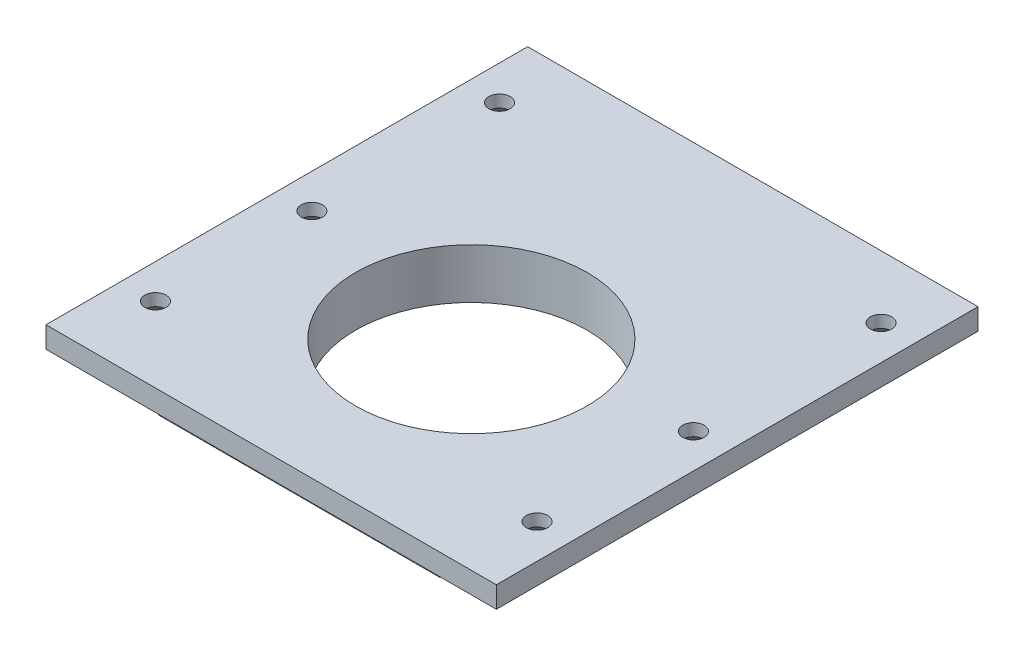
ISO-10303-21;
HEADER;
FILE_DESCRIPTION(('STEP AP214'),'2;1');
FILE_NAME('part.step','',(''),(''),'','','');
FILE_SCHEMA(('AUTOMOTIVE_DESIGN { 1 0 10303 214 1 1 1 1 }'));
ENDSEC;
DATA;
#1=APPLICATION_CONTEXT('core data for automotive mechanical design processes');
#2=APPLICATION_PROTOCOL_DEFINITION('international standard','automotive_design',2000,#1);
#3=PRODUCT_CONTEXT('',#1,'mechanical');
#4=PRODUCT('Part','Part','',(#3));
#5=PRODUCT_RELATED_PRODUCT_CATEGORY('part','',(#4));
#6=PRODUCT_DEFINITION_FORMATION('','',#4);
#7=PRODUCT_DEFINITION_CONTEXT('part definition',#1,'design');
#8=PRODUCT_DEFINITION('design','',#6,#7);
#9=PRODUCT_DEFINITION_SHAPE('','',#8);
#10=(LENGTH_UNIT() NAMED_UNIT(*) SI_UNIT(.MILLI.,.METRE.));
#11=(NAMED_UNIT(*) PLANE_ANGLE_UNIT() SI_UNIT($,.RADIAN.));
#12=(NAMED_UNIT(*) SI_UNIT($,.STERADIAN.) SOLID_ANGLE_UNIT());
#13=UNCERTAINTY_MEASURE_WITH_UNIT(LENGTH_MEASURE(1.E-05),#10,'distance_accuracy_value','');
#14=(GEOMETRIC_REPRESENTATION_CONTEXT(3) GLOBAL_UNCERTAINTY_ASSIGNED_CONTEXT((#13)) GLOBAL_UNIT_ASSIGNED_CONTEXT((#10,
#11,#12)) REPRESENTATION_CONTEXT('',''));
#15=CARTESIAN_POINT('',(0.,0.,0.));
#16=DIRECTION('',(0.,0.,1.));
#17=DIRECTION('',(1.,0.,0.));
#18=AXIS2_PLACEMENT_3D('',#15,#16,#17);
#19=CARTESIAN_POINT('',(36.,-4.,-45.));
#20=DIRECTION('',(0.,0.,1.));
#21=DIRECTION('',(1.,0.,0.));
#22=AXIS2_PLACEMENT_3D('',#19,#20,#21);
#23=PLANE('',#22);
#24=DIRECTION('',(0.,1.,0.));
#25=VECTOR('',#24,1.);
#26=CARTESIAN_POINT('',(36.,-4.,-45.));
#27=LINE('',#26,#25);
#28=CARTESIAN_POINT('',(36.,0.6,-45.));
#29=VERTEX_POINT('',#28);
#30=CARTESIAN_POINT('',(36.,4.,-45.));
#31=VERTEX_POINT('',#30);
#32=EDGE_CURVE('E247',#29,#31,#27,.T.);
#33=ORIENTED_EDGE('',*,*,#32,.F.);
#34=DIRECTION('',(1.,0.,0.));
#35=VECTOR('',#34,1.);
#36=CARTESIAN_POINT('',(-26.,0.599999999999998,-45.));
#37=LINE('',#36,#35);
#38=CARTESIAN_POINT('',(-36.,0.6,-45.));
#39=VERTEX_POINT('',#38);
#40=EDGE_CURVE('E234',#39,#29,#37,.T.);
#41=ORIENTED_EDGE('',*,*,#40,.F.);
#42=DIRECTION('',(0.,1.,0.));
#43=VECTOR('',#42,1.);
#44=CARTESIAN_POINT('',(-36.,-4.,-45.));
#45=LINE('',#44,#43);
#46=CARTESIAN_POINT('',(-36.,4.,-45.));
#47=VERTEX_POINT('',#46);
#48=EDGE_CURVE('E244',#39,#47,#45,.T.);
#49=ORIENTED_EDGE('',*,*,#48,.T.);
#50=DIRECTION('',(-1.,0.,0.));
#51=VECTOR('',#50,1.);
#52=CARTESIAN_POINT('',(36.,4.,-45.));
#53=LINE('',#52,#51);
#54=EDGE_CURVE('E263',#31,#47,#53,.T.);
#55=ORIENTED_EDGE('',*,*,#54,.F.);
#56=EDGE_LOOP('',(#33,#41,#49,#55));
#57=FACE_BOUND('',#56,.T.);
#58=ADVANCED_FACE('F34',(#57),#23,.F.);
#59=CARTESIAN_POINT('',(36.,-4.,32.));
#60=DIRECTION('',(0.,0.,-1.));
#61=DIRECTION('',(-1.,0.,0.));
#62=AXIS2_PLACEMENT_3D('',#59,#60,#61);
#63=PLANE('',#62);
#64=DIRECTION('',(-1.,0.,0.));
#65=VECTOR('',#64,1.);
#66=CARTESIAN_POINT('',(-26.,0.599999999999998,32.));
#67=LINE('',#66,#65);
#68=CARTESIAN_POINT('',(36.,0.6,32.));
#69=VERTEX_POINT('',#68);
#70=CARTESIAN_POINT('',(-36.,0.6,32.));
#71=VERTEX_POINT('',#70);
#72=EDGE_CURVE('E230',#69,#71,#67,.T.);
#73=ORIENTED_EDGE('',*,*,#72,.F.);
#74=DIRECTION('',(0.,-1.,0.));
#75=VECTOR('',#74,1.);
#76=CARTESIAN_POINT('',(36.,-4.,32.));
#77=LINE('',#76,#75);
#78=CARTESIAN_POINT('',(36.,4.,32.));
#79=VERTEX_POINT('',#78);
#80=EDGE_CURVE('E252',#79,#69,#77,.T.);
#81=ORIENTED_EDGE('',*,*,#80,.F.);
#82=DIRECTION('',(-1.,0.,0.));
#83=VECTOR('',#82,1.);
#84=CARTESIAN_POINT('',(36.,4.,32.));
#85=LINE('',#84,#83);
#86=CARTESIAN_POINT('',(-36.,4.,32.));
#87=VERTEX_POINT('',#86);
#88=EDGE_CURVE('E255',#79,#87,#85,.T.);
#89=ORIENTED_EDGE('',*,*,#88,.T.);
#90=DIRECTION('',(0.,-1.,0.));
#91=VECTOR('',#90,1.);
#92=CARTESIAN_POINT('',(-36.,-4.,32.));
#93=LINE('',#92,#91);
#94=EDGE_CURVE('E250',#87,#71,#93,.T.);
#95=ORIENTED_EDGE('',*,*,#94,.T.);
#96=EDGE_LOOP('',(#73,#81,#89,#95));
#97=FACE_BOUND('',#96,.T.);
#98=ADVANCED_FACE('F392',(#97),#63,.F.);
#99=CARTESIAN_POINT('',(36.,0.,0.));
#100=DIRECTION('',(-1.,0.,0.));
#101=DIRECTION('',(0.,0.,1.));
#102=AXIS2_PLACEMENT_3D('',#99,#100,#101);
#103=PLANE('',#102);
#104=DIRECTION('',(0.,0.,-1.));
#105=VECTOR('',#104,1.);
#106=CARTESIAN_POINT('',(36.,0.6,-45.));
#107=LINE('',#106,#105);
#108=EDGE_CURVE('E220',#69,#29,#107,.T.);
#109=ORIENTED_EDGE('',*,*,#108,.T.);
#110=ORIENTED_EDGE('',*,*,#32,.T.);
#111=DIRECTION('',(0.,0.,1.));
#112=VECTOR('',#111,1.);
#113=CARTESIAN_POINT('',(36.,4.,32.));
#114=LINE('',#113,#112);
#115=EDGE_CURVE('E249',#31,#79,#114,.T.);
#116=ORIENTED_EDGE('',*,*,#115,.T.);
#117=ORIENTED_EDGE('',*,*,#80,.T.);
#118=EDGE_LOOP('',(#109,#110,#116,#117));
#119=FACE_BOUND('',#118,.T.);
#120=ADVANCED_FACE('F401',(#119),#103,.F.);
#121=CARTESIAN_POINT('',(36.,0.5,32.));
#122=DIRECTION('',(0.,-1.,0.));
#123=DIRECTION('',(1.,0.,0.));
#124=AXIS2_PLACEMENT_3D('',#121,#122,#123);
#125=PLANE('',#124);
#126=DIRECTION('',(0.,0.,-1.));
#127=VECTOR('',#126,1.);
#128=CARTESIAN_POINT('',(20.4019237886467,0.499999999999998,32.));
#129=LINE('',#128,#127);
#130=CARTESIAN_POINT('',(20.4019237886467,0.499999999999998,27.5));
#131=VERTEX_POINT('',#130);
#132=CARTESIAN_POINT('',(20.4019237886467,0.499999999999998,-27.5));
#133=VERTEX_POINT('',#132);
#134=EDGE_CURVE('E223',#131,#133,#129,.T.);
#135=ORIENTED_EDGE('',*,*,#134,.T.);
#136=DIRECTION('',(-1.,0.,0.));
#137=VECTOR('',#136,1.);
#138=CARTESIAN_POINT('',(36.,0.5,-27.5));
#139=LINE('',#138,#137);
#140=CARTESIAN_POINT('',(26.,0.5,-27.5));
#141=VERTEX_POINT('',#140);
#142=EDGE_CURVE('E188',#141,#133,#139,.T.);
#143=ORIENTED_EDGE('',*,*,#142,.F.);
#144=DIRECTION('',(0.,0.,1.));
#145=VECTOR('',#144,1.);
#146=CARTESIAN_POINT('',(26.,0.499999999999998,-45.));
#147=LINE('',#146,#145);
#148=CARTESIAN_POINT('',(26.,0.5,27.5));
#149=VERTEX_POINT('',#148);
#150=EDGE_CURVE('E217',#141,#149,#147,.T.);
#151=ORIENTED_EDGE('',*,*,#150,.T.);
#152=DIRECTION('',(1.,0.,0.));
#153=VECTOR('',#152,1.);
#154=CARTESIAN_POINT('',(36.,0.5,27.5));
#155=LINE('',#154,#153);
#156=EDGE_CURVE('E209',#131,#149,#155,.T.);
#157=ORIENTED_EDGE('',*,*,#156,.F.);
#158=EDGE_LOOP('',(#135,#143,#151,#157));
#159=FACE_BOUND('',#158,.T.);
#160=ADVANCED_FACE('F367',(#159),#125,.T.);
#161=CARTESIAN_POINT('',(36.,-4.,32.));
#162=DIRECTION('',(0.,1.,0.));
#163=DIRECTION('',(0.,0.,1.));
#164=AXIS2_PLACEMENT_3D('',#161,#162,#163);
#165=PLANE('',#164);
#166=CARTESIAN_POINT('',(-15.,-4.,22.5));
#167=DIRECTION('',(0.,-1.,0.));
#168=DIRECTION('',(0.,0.,-1.));
#169=AXIS2_PLACEMENT_3D('',#166,#167,#168);
#170=CIRCLE('',#169,0.499999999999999);
#171=CARTESIAN_POINT('',(-15.,-4.,22.));
#172=VERTEX_POINT('',#171);
#173=EDGE_CURVE('E341',#172,#172,#170,.T.);
#174=ORIENTED_EDGE('',*,*,#173,.F.);
#175=EDGE_LOOP('',(#174));
#176=FACE_BOUND('',#175,.T.);
#177=CARTESIAN_POINT('',(15.,-4.,22.5));
#178=DIRECTION('',(0.,-1.,0.));
#179=DIRECTION('',(0.,0.,-1.));
#180=AXIS2_PLACEMENT_3D('',#177,#178,#179);
#181=CIRCLE('',#180,0.499999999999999);
#182=CARTESIAN_POINT('',(15.,-4.,22.));
#183=VERTEX_POINT('',#182);
#184=EDGE_CURVE('E347',#183,#183,#181,.T.);
#185=ORIENTED_EDGE('',*,*,#184,.F.);
#186=EDGE_LOOP('',(#185));
#187=FACE_BOUND('',#186,.T.);
#188=CARTESIAN_POINT('',(15.,-4.,-22.5));
#189=DIRECTION('',(0.,-1.,0.));
#190=DIRECTION('',(0.,0.,-1.));
#191=AXIS2_PLACEMENT_3D('',#188,#189,#190);
#192=CIRCLE('',#191,0.499999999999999);
#193=CARTESIAN_POINT('',(15.,-4.,-23.));
#194=VERTEX_POINT('',#193);
#195=EDGE_CURVE('E353',#194,#194,#192,.T.);
#196=ORIENTED_EDGE('',*,*,#195,.F.);
#197=EDGE_LOOP('',(#196));
#198=FACE_BOUND('',#197,.T.);
#199=CARTESIAN_POINT('',(-15.,-4.,-22.5));
#200=DIRECTION('',(0.,-1.,0.));
#201=DIRECTION('',(0.,0.,-1.));
#202=AXIS2_PLACEMENT_3D('',#199,#200,#201);
#203=CIRCLE('',#202,0.499999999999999);
#204=CARTESIAN_POINT('',(-15.,-4.,-23.));
#205=VERTEX_POINT('',#204);
#206=EDGE_CURVE('E180',#205,#205,#203,.T.);
#207=ORIENTED_EDGE('',*,*,#206,.F.);
#208=EDGE_LOOP('',(#207));
#209=FACE_BOUND('',#208,.T.);
#210=CARTESIAN_POINT('',(0.,-4.,0.));
#211=DIRECTION('',(0.,1.,0.));
#212=DIRECTION('',(0.,0.,1.));
#213=AXIS2_PLACEMENT_3D('',#210,#211,#212);
#214=CIRCLE('',#213,18.5);
#215=CARTESIAN_POINT('',(0.,-4.,18.5));
#216=VERTEX_POINT('',#215);
#217=EDGE_CURVE('E241',#216,#216,#214,.T.);
#218=ORIENTED_EDGE('',*,*,#217,.T.);
#219=EDGE_LOOP('',(#218));
#220=FACE_BOUND('',#219,.T.);
#221=DIRECTION('',(-1.,0.,0.));
#222=VECTOR('',#221,1.);
#223=CARTESIAN_POINT('',(-26.,-4.,-27.5));
#224=LINE('',#223,#222);
#225=CARTESIAN_POINT('',(20.7679491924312,-4.,-27.5));
#226=VERTEX_POINT('',#225);
#227=CARTESIAN_POINT('',(-20.7679491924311,-4.,-27.5));
#228=VERTEX_POINT('',#227);
#229=EDGE_CURVE('E168',#226,#228,#224,.T.);
#230=ORIENTED_EDGE('',*,*,#229,.F.);
#231=DIRECTION('',(-0.499999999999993,0.,-0.866025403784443));
#232=VECTOR('',#231,1.);
#233=CARTESIAN_POINT('',(22.5,-4.,-24.5));
#234=LINE('',#233,#232);
#235=CARTESIAN_POINT('',(22.5,-4.,-24.5));
#236=VERTEX_POINT('',#235);
#237=EDGE_CURVE('E156',#236,#226,#234,.T.);
#238=ORIENTED_EDGE('',*,*,#237,.F.);
#239=DIRECTION('',(0.,0.,1.));
#240=VECTOR('',#239,1.);
#241=CARTESIAN_POINT('',(22.5,-4.,-45.));
#242=LINE('',#241,#240);
#243=CARTESIAN_POINT('',(22.5,-4.,27.5));
#244=VERTEX_POINT('',#243);
#245=EDGE_CURVE('E284',#236,#244,#242,.T.);
#246=ORIENTED_EDGE('',*,*,#245,.T.);
#247=DIRECTION('',(1.,0.,0.));
#248=VECTOR('',#247,1.);
#249=CARTESIAN_POINT('',(-26.,-4.,27.5));
#250=LINE('',#249,#248);
#251=CARTESIAN_POINT('',(-22.5,-4.,27.5));
#252=VERTEX_POINT('',#251);
#253=EDGE_CURVE('E195',#252,#244,#250,.T.);
#254=ORIENTED_EDGE('',*,*,#253,.F.);
#255=DIRECTION('',(0.,0.,1.));
#256=VECTOR('',#255,1.);
#257=CARTESIAN_POINT('',(-22.5,-4.,-45.));
#258=LINE('',#257,#256);
#259=CARTESIAN_POINT('',(-22.5,-4.,-24.5));
#260=VERTEX_POINT('',#259);
#261=EDGE_CURVE('E269',#260,#252,#258,.T.);
#262=ORIENTED_EDGE('',*,*,#261,.F.);
#263=DIRECTION('',(-0.499999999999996,0.,0.866025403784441));
#264=VECTOR('',#263,1.);
#265=CARTESIAN_POINT('',(-22.5,-4.,-24.5));
#266=LINE('',#265,#264);
#267=EDGE_CURVE('E55',#228,#260,#266,.T.);
#268=ORIENTED_EDGE('',*,*,#267,.F.);
#269=EDGE_LOOP('',(#230,#238,#246,#254,#262,#268));
#270=FACE_BOUND('',#269,.T.);
#271=ADVANCED_FACE('F172',(#176,#187,#198,#209,#220,#270),#165,.F.);
#272=CARTESIAN_POINT('',(-36.,0.,0.));
#273=DIRECTION('',(-1.,0.,0.));
#274=DIRECTION('',(0.,0.,1.));
#275=AXIS2_PLACEMENT_3D('',#272,#273,#274);
#276=PLANE('',#275);
#277=ORIENTED_EDGE('',*,*,#48,.F.);
#278=DIRECTION('',(0.,0.,-1.));
#279=VECTOR('',#278,1.);
#280=CARTESIAN_POINT('',(-36.,0.6,-45.));
#281=LINE('',#280,#279);
#282=EDGE_CURVE('E232',#71,#39,#281,.T.);
#283=ORIENTED_EDGE('',*,*,#282,.F.);
#284=ORIENTED_EDGE('',*,*,#94,.F.);
#285=DIRECTION('',(0.,0.,1.));
#286=VECTOR('',#285,1.);
#287=CARTESIAN_POINT('',(-36.,4.,32.));
#288=LINE('',#287,#286);
#289=EDGE_CURVE('E257',#47,#87,#288,.T.);
#290=ORIENTED_EDGE('',*,*,#289,.F.);
#291=EDGE_LOOP('',(#277,#283,#284,#290));
#292=FACE_BOUND('',#291,.T.);
#293=ADVANCED_FACE('F366',(#292),#276,.T.);
#294=CARTESIAN_POINT('',(36.,4.,32.));
#295=DIRECTION('',(0.,-1.,0.));
#296=DIRECTION('',(0.,0.,-1.));
#297=AXIS2_PLACEMENT_3D('',#294,#295,#296);
#298=PLANE('',#297);
#299=CARTESIAN_POINT('',(-30.5,4.00000000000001,20.));
#300=DIRECTION('',(0.,-1.,0.));
#301=DIRECTION('',(0.,0.,-1.));
#302=AXIS2_PLACEMENT_3D('',#299,#300,#301);
#303=CIRCLE('',#302,1.7);
#304=CARTESIAN_POINT('',(-30.5,4.00000000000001,18.3));
#305=VERTEX_POINT('',#304);
#306=EDGE_CURVE('E293',#305,#305,#303,.T.);
#307=ORIENTED_EDGE('',*,*,#306,.T.);
#308=EDGE_LOOP('',(#307));
#309=FACE_BOUND('',#308,.T.);
#310=CARTESIAN_POINT('',(-30.5,4.00000000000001,-4.99999999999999));
#311=DIRECTION('',(0.,-1.,0.));
#312=DIRECTION('',(0.,0.,-1.));
#313=AXIS2_PLACEMENT_3D('',#310,#311,#312);
#314=CIRCLE('',#313,1.7);
#315=CARTESIAN_POINT('',(-30.5,4.00000000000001,-6.69999999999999));
#316=VERTEX_POINT('',#315);
#317=EDGE_CURVE('E302',#316,#316,#314,.T.);
#318=ORIENTED_EDGE('',*,*,#317,.T.);
#319=EDGE_LOOP('',(#318));
#320=FACE_BOUND('',#319,.T.);
#321=CARTESIAN_POINT('',(-30.5,4.00000000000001,-35.));
#322=DIRECTION('',(0.,-1.,0.));
#323=DIRECTION('',(0.,0.,-1.));
#324=AXIS2_PLACEMENT_3D('',#321,#322,#323);
#325=CIRCLE('',#324,1.7);
#326=CARTESIAN_POINT('',(-30.5,4.00000000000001,-36.7));
#327=VERTEX_POINT('',#326);
#328=EDGE_CURVE('E311',#327,#327,#325,.T.);
#329=ORIENTED_EDGE('',*,*,#328,.T.);
#330=EDGE_LOOP('',(#329));
#331=FACE_BOUND('',#330,.T.);
#332=CARTESIAN_POINT('',(30.5,4.,-35.));
#333=DIRECTION('',(0.,-1.,0.));
#334=DIRECTION('',(0.,0.,-1.));
#335=AXIS2_PLACEMENT_3D('',#332,#333,#334);
#336=CIRCLE('',#335,1.7);
#337=CARTESIAN_POINT('',(30.5,4.,-36.7));
#338=VERTEX_POINT('',#337);
#339=EDGE_CURVE('E320',#338,#338,#336,.T.);
#340=ORIENTED_EDGE('',*,*,#339,.T.);
#341=EDGE_LOOP('',(#340));
#342=FACE_BOUND('',#341,.T.);
#343=CARTESIAN_POINT('',(30.5,4.,-4.99999999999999));
#344=DIRECTION('',(0.,-1.,0.));
#345=DIRECTION('',(0.,0.,-1.));
#346=AXIS2_PLACEMENT_3D('',#343,#344,#345);
#347=CIRCLE('',#346,1.7);
#348=CARTESIAN_POINT('',(30.5,4.,-6.69999999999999));
#349=VERTEX_POINT('',#348);
#350=EDGE_CURVE('E329',#349,#349,#347,.T.);
#351=ORIENTED_EDGE('',*,*,#350,.T.);
#352=EDGE_LOOP('',(#351));
#353=FACE_BOUND('',#352,.T.);
#354=CARTESIAN_POINT('',(30.5,4.,20.));
#355=DIRECTION('',(0.,-1.,0.));
#356=DIRECTION('',(0.,0.,-1.));
#357=AXIS2_PLACEMENT_3D('',#354,#355,#356);
#358=CIRCLE('',#357,1.7);
#359=CARTESIAN_POINT('',(30.5,4.,18.3));
#360=VERTEX_POINT('',#359);
#361=EDGE_CURVE('E338',#360,#360,#358,.T.);
#362=ORIENTED_EDGE('',*,*,#361,.T.);
#363=EDGE_LOOP('',(#362));
#364=FACE_BOUND('',#363,.T.);
#365=CARTESIAN_POINT('',(0.,4.,0.));
#366=DIRECTION('',(0.,1.,0.));
#367=DIRECTION('',(0.,0.,1.));
#368=AXIS2_PLACEMENT_3D('',#365,#366,#367);
#369=CIRCLE('',#368,18.5);
#370=CARTESIAN_POINT('',(0.,4.,18.5));
#371=VERTEX_POINT('',#370);
#372=EDGE_CURVE('E240',#371,#371,#369,.T.);
#373=ORIENTED_EDGE('',*,*,#372,.F.);
#374=EDGE_LOOP('',(#373));
#375=FACE_BOUND('',#374,.T.);
#376=ORIENTED_EDGE('',*,*,#289,.T.);
#377=ORIENTED_EDGE('',*,*,#88,.F.);
#378=ORIENTED_EDGE('',*,*,#115,.F.);
#379=ORIENTED_EDGE('',*,*,#54,.T.);
#380=EDGE_LOOP('',(#376,#377,#378,#379));
#381=FACE_BOUND('',#380,.T.);
#382=ADVANCED_FACE('F376',(#309,#320,#331,#342,#353,#364,#375,#381),#298,.F.);
#383=CARTESIAN_POINT('',(0.,-4.,0.));
#384=DIRECTION('',(0.,1.,0.));
#385=DIRECTION('',(0.,0.,1.));
#386=AXIS2_PLACEMENT_3D('',#383,#384,#385);
#387=CYLINDRICAL_SURFACE('',#386,18.5);
#388=ORIENTED_EDGE('',*,*,#217,.F.);
#389=EDGE_LOOP('',(#388));
#390=FACE_BOUND('',#389,.T.);
#391=ORIENTED_EDGE('',*,*,#372,.T.);
#392=EDGE_LOOP('',(#391));
#393=FACE_BOUND('',#392,.T.);
#394=ADVANCED_FACE('F372',(#390,#393),#387,.F.);
#395=CARTESIAN_POINT('',(-36.,0.5,32.));
#396=DIRECTION('',(0.,1.,0.));
#397=DIRECTION('',(-1.,0.,0.));
#398=AXIS2_PLACEMENT_3D('',#395,#396,#397);
#399=PLANE('',#398);
#400=DIRECTION('',(1.,0.,0.));
#401=VECTOR('',#400,1.);
#402=CARTESIAN_POINT('',(-36.,0.5,-27.5));
#403=LINE('',#402,#401);
#404=CARTESIAN_POINT('',(-26.,0.5,-27.5));
#405=VERTEX_POINT('',#404);
#406=CARTESIAN_POINT('',(-20.4019237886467,0.499999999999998,-27.5));
#407=VERTEX_POINT('',#406);
#408=EDGE_CURVE('E193',#405,#407,#403,.T.);
#409=ORIENTED_EDGE('',*,*,#408,.T.);
#410=DIRECTION('',(0.,0.,-1.));
#411=VECTOR('',#410,1.);
#412=CARTESIAN_POINT('',(-20.4019237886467,0.499999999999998,32.));
#413=LINE('',#412,#411);
#414=CARTESIAN_POINT('',(-20.4019237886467,0.499999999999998,27.5));
#415=VERTEX_POINT('',#414);
#416=EDGE_CURVE('E236',#415,#407,#413,.T.);
#417=ORIENTED_EDGE('',*,*,#416,.F.);
#418=DIRECTION('',(-1.,0.,0.));
#419=VECTOR('',#418,1.);
#420=CARTESIAN_POINT('',(-36.,0.5,27.5));
#421=LINE('',#420,#419);
#422=CARTESIAN_POINT('',(-26.,0.5,27.5));
#423=VERTEX_POINT('',#422);
#424=EDGE_CURVE('E214',#415,#423,#421,.T.);
#425=ORIENTED_EDGE('',*,*,#424,.T.);
#426=DIRECTION('',(0.,0.,1.));
#427=VECTOR('',#426,1.);
#428=CARTESIAN_POINT('',(-26.,0.499999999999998,-45.));
#429=LINE('',#428,#427);
#430=EDGE_CURVE('E227',#405,#423,#429,.T.);
#431=ORIENTED_EDGE('',*,*,#430,.F.);
#432=EDGE_LOOP('',(#409,#417,#425,#431));
#433=FACE_BOUND('',#432,.T.);
#434=ADVANCED_FACE('F375',(#433),#399,.F.);
#435=CARTESIAN_POINT('',(-20.4019237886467,0.499999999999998,32.));
#436=DIRECTION('',(0.86602540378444,-0.499999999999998,0.));
#437=DIRECTION('',(0.499999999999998,0.86602540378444,0.));
#438=AXIS2_PLACEMENT_3D('',#435,#436,#437);
#439=PLANE('',#438);
#440=DIRECTION('',(-0.499999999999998,-0.86602540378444,0.));
#441=VECTOR('',#440,1.);
#442=CARTESIAN_POINT('',(-20.4019237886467,0.499999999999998,-27.5));
#443=LINE('',#442,#441);
#444=CARTESIAN_POINT('',(-20.7679491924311,-0.133974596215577,-27.5));
#445=VERTEX_POINT('',#444);
#446=EDGE_CURVE('E190',#407,#445,#443,.T.);
#447=ORIENTED_EDGE('',*,*,#446,.T.);
#448=DIRECTION('',(-0.377964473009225,-0.654653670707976,0.65465367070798));
#449=VECTOR('',#448,1.);
#450=CARTESIAN_POINT('',(-35.2812236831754,-25.2717033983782,-2.36227119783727));
#451=LINE('',#450,#449);
#452=CARTESIAN_POINT('',(-22.5,-3.13397459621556,-24.5));
#453=VERTEX_POINT('',#452);
#454=EDGE_CURVE('E278',#445,#453,#451,.T.);
#455=ORIENTED_EDGE('',*,*,#454,.T.);
#456=DIRECTION('',(0.,0.,1.));
#457=VECTOR('',#456,1.);
#458=CARTESIAN_POINT('',(-22.5,-3.13397459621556,-45.));
#459=LINE('',#458,#457);
#460=CARTESIAN_POINT('',(-22.5,-3.13397459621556,27.5));
#461=VERTEX_POINT('',#460);
#462=EDGE_CURVE('E271',#453,#461,#459,.T.);
#463=ORIENTED_EDGE('',*,*,#462,.T.);
#464=DIRECTION('',(0.499999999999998,0.86602540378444,0.));
#465=VECTOR('',#464,1.);
#466=CARTESIAN_POINT('',(-20.4019237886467,0.499999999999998,27.5));
#467=LINE('',#466,#465);
#468=EDGE_CURVE('E212',#461,#415,#467,.T.);
#469=ORIENTED_EDGE('',*,*,#468,.T.);
#470=ORIENTED_EDGE('',*,*,#416,.T.);
#471=EDGE_LOOP('',(#447,#455,#463,#469,#470));
#472=FACE_BOUND('',#471,.T.);
#473=ADVANCED_FACE('F456',(#472),#439,.F.);
#474=CARTESIAN_POINT('',(-26.,0.599999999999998,-45.));
#475=DIRECTION('',(1.,0.,0.));
#476=DIRECTION('',(0.,1.,0.));
#477=AXIS2_PLACEMENT_3D('',#474,#475,#476);
#478=PLANE('',#477);
#479=DIRECTION('',(0.,0.,1.));
#480=VECTOR('',#479,1.);
#481=CARTESIAN_POINT('',(-26.,0.599999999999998,-45.));
#482=LINE('',#481,#480);
#483=CARTESIAN_POINT('',(-26.,0.599999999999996,-27.5));
#484=VERTEX_POINT('',#483);
#485=CARTESIAN_POINT('',(-26.,0.599999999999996,27.5));
#486=VERTEX_POINT('',#485);
#487=EDGE_CURVE('E228',#484,#486,#482,.T.);
#488=ORIENTED_EDGE('',*,*,#487,.F.);
#489=DIRECTION('',(0.,-1.,0.));
#490=VECTOR('',#489,1.);
#491=CARTESIAN_POINT('',(-26.,55.4657452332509,-27.5));
#492=LINE('',#491,#490);
#493=EDGE_CURVE('E177',#484,#405,#492,.T.);
#494=ORIENTED_EDGE('',*,*,#493,.T.);
#495=ORIENTED_EDGE('',*,*,#430,.T.);
#496=DIRECTION('',(0.,-1.,0.));
#497=VECTOR('',#496,1.);
#498=CARTESIAN_POINT('',(-26.,52.7943483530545,27.5));
#499=LINE('',#498,#497);
#500=EDGE_CURVE('E198',#486,#423,#499,.T.);
#501=ORIENTED_EDGE('',*,*,#500,.F.);
#502=EDGE_LOOP('',(#488,#494,#495,#501));
#503=FACE_BOUND('',#502,.T.);
#504=ADVANCED_FACE('F464',(#503),#478,.F.);
#505=CARTESIAN_POINT('',(0.,0.599999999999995,0.));
#506=DIRECTION('',(0.,-1.,0.));
#507=DIRECTION('',(1.,0.,0.));
#508=AXIS2_PLACEMENT_3D('',#505,#506,#507);
#509=PLANE('',#508);
#510=CARTESIAN_POINT('',(-30.5,0.599999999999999,20.));
#511=DIRECTION('',(0.,-1.,0.));
#512=DIRECTION('',(0.,0.,-1.));
#513=AXIS2_PLACEMENT_3D('',#510,#511,#512);
#514=CIRCLE('',#513,3.15);
#515=CARTESIAN_POINT('',(-30.5,0.599999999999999,16.85));
#516=VERTEX_POINT('',#515);
#517=EDGE_CURVE('E286',#516,#516,#514,.T.);
#518=ORIENTED_EDGE('',*,*,#517,.F.);
#519=EDGE_LOOP('',(#518));
#520=FACE_BOUND('',#519,.T.);
#521=CARTESIAN_POINT('',(-30.5,0.599999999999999,-4.99999999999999));
#522=DIRECTION('',(0.,-1.,0.));
#523=DIRECTION('',(0.,0.,-1.));
#524=AXIS2_PLACEMENT_3D('',#521,#522,#523);
#525=CIRCLE('',#524,3.15);
#526=CARTESIAN_POINT('',(-30.5,0.599999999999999,-8.14999999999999));
#527=VERTEX_POINT('',#526);
#528=EDGE_CURVE('E296',#527,#527,#525,.T.);
#529=ORIENTED_EDGE('',*,*,#528,.F.);
#530=EDGE_LOOP('',(#529));
#531=FACE_BOUND('',#530,.T.);
#532=CARTESIAN_POINT('',(-30.5,0.599999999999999,-35.));
#533=DIRECTION('',(0.,-1.,0.));
#534=DIRECTION('',(0.,0.,-1.));
#535=AXIS2_PLACEMENT_3D('',#532,#533,#534);
#536=CIRCLE('',#535,3.15);
#537=CARTESIAN_POINT('',(-30.5,0.599999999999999,-38.15));
#538=VERTEX_POINT('',#537);
#539=EDGE_CURVE('E305',#538,#538,#536,.T.);
#540=ORIENTED_EDGE('',*,*,#539,.F.);
#541=EDGE_LOOP('',(#540));
#542=FACE_BOUND('',#541,.T.);
#543=CARTESIAN_POINT('',(30.5,0.599999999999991,-35.));
#544=DIRECTION('',(0.,-1.,0.));
#545=DIRECTION('',(0.,0.,-1.));
#546=AXIS2_PLACEMENT_3D('',#543,#544,#545);
#547=CIRCLE('',#546,3.15);
#548=CARTESIAN_POINT('',(30.5,0.599999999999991,-38.15));
#549=VERTEX_POINT('',#548);
#550=EDGE_CURVE('E314',#549,#549,#547,.T.);
#551=ORIENTED_EDGE('',*,*,#550,.F.);
#552=EDGE_LOOP('',(#551));
#553=FACE_BOUND('',#552,.T.);
#554=CARTESIAN_POINT('',(30.5,0.599999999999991,-4.99999999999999));
#555=DIRECTION('',(0.,-1.,0.));
#556=DIRECTION('',(0.,0.,-1.));
#557=AXIS2_PLACEMENT_3D('',#554,#555,#556);
#558=CIRCLE('',#557,3.15);
#559=CARTESIAN_POINT('',(30.5,0.599999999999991,-8.14999999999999));
#560=VERTEX_POINT('',#559);
#561=EDGE_CURVE('E323',#560,#560,#558,.T.);
#562=ORIENTED_EDGE('',*,*,#561,.F.);
#563=EDGE_LOOP('',(#562));
#564=FACE_BOUND('',#563,.T.);
#565=CARTESIAN_POINT('',(30.5,0.599999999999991,20.));
#566=DIRECTION('',(0.,-1.,0.));
#567=DIRECTION('',(0.,0.,-1.));
#568=AXIS2_PLACEMENT_3D('',#565,#566,#567);
#569=CIRCLE('',#568,3.15);
#570=CARTESIAN_POINT('',(30.5,0.599999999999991,16.85));
#571=VERTEX_POINT('',#570);
#572=EDGE_CURVE('E332',#571,#571,#569,.T.);
#573=ORIENTED_EDGE('',*,*,#572,.F.);
#574=EDGE_LOOP('',(#573));
#575=FACE_BOUND('',#574,.T.);
#576=DIRECTION('',(1.,0.,0.));
#577=VECTOR('',#576,1.);
#578=CARTESIAN_POINT('',(-26.,0.599999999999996,-27.5));
#579=LINE('',#578,#577);
#580=CARTESIAN_POINT('',(26.,0.599999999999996,-27.5));
#581=VERTEX_POINT('',#580);
#582=EDGE_CURVE('E184',#484,#581,#579,.T.);
#583=ORIENTED_EDGE('',*,*,#582,.F.);
#584=ORIENTED_EDGE('',*,*,#487,.T.);
#585=DIRECTION('',(-1.,0.,0.));
#586=VECTOR('',#585,1.);
#587=CARTESIAN_POINT('',(-26.,0.599999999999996,27.5));
#588=LINE('',#587,#586);
#589=CARTESIAN_POINT('',(26.,0.599999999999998,27.5));
#590=VERTEX_POINT('',#589);
#591=EDGE_CURVE('E202',#590,#486,#588,.T.);
#592=ORIENTED_EDGE('',*,*,#591,.F.);
#593=DIRECTION('',(0.,0.,1.));
#594=VECTOR('',#593,1.);
#595=CARTESIAN_POINT('',(26.,0.599999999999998,-45.));
#596=LINE('',#595,#594);
#597=EDGE_CURVE('E218',#581,#590,#596,.T.);
#598=ORIENTED_EDGE('',*,*,#597,.F.);
#599=EDGE_LOOP('',(#583,#584,#592,#598));
#600=FACE_BOUND('',#599,.T.);
#601=ORIENTED_EDGE('',*,*,#40,.T.);
#602=ORIENTED_EDGE('',*,*,#108,.F.);
#603=ORIENTED_EDGE('',*,*,#72,.T.);
#604=ORIENTED_EDGE('',*,*,#282,.T.);
#605=EDGE_LOOP('',(#601,#602,#603,#604));
#606=FACE_BOUND('',#605,.T.);
#607=ADVANCED_FACE('F396',(#520,#531,#542,#553,#564,#575,#600,#606),#509,.T.);
#608=CARTESIAN_POINT('',(20.4019237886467,0.499999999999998,32.));
#609=DIRECTION('',(0.86602540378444,0.499999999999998,0.));
#610=DIRECTION('',(-0.499999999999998,0.86602540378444,0.));
#611=AXIS2_PLACEMENT_3D('',#608,#609,#610);
#612=PLANE('',#611);
#613=DIRECTION('',(0.377964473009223,-0.654653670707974,0.654653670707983));
#614=VECTOR('',#613,1.);
#615=CARTESIAN_POINT('',(35.2812236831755,-25.2717033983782,-2.36227119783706));
#616=LINE('',#615,#614);
#617=CARTESIAN_POINT('',(20.7679491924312,-0.1339745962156,-27.5));
#618=VERTEX_POINT('',#617);
#619=CARTESIAN_POINT('',(22.5,-3.13397459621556,-24.5));
#620=VERTEX_POINT('',#619);
#621=EDGE_CURVE('E48',#618,#620,#616,.T.);
#622=ORIENTED_EDGE('',*,*,#621,.F.);
#623=DIRECTION('',(0.499999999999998,-0.86602540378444,0.));
#624=VECTOR('',#623,1.);
#625=CARTESIAN_POINT('',(20.4019237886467,0.499999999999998,-27.5));
#626=LINE('',#625,#624);
#627=EDGE_CURVE('E170',#133,#618,#626,.T.);
#628=ORIENTED_EDGE('',*,*,#627,.F.);
#629=ORIENTED_EDGE('',*,*,#134,.F.);
#630=DIRECTION('',(-0.499999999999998,0.86602540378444,0.));
#631=VECTOR('',#630,1.);
#632=CARTESIAN_POINT('',(20.4019237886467,0.499999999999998,27.5));
#633=LINE('',#632,#631);
#634=CARTESIAN_POINT('',(22.5,-3.13397459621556,27.5));
#635=VERTEX_POINT('',#634);
#636=EDGE_CURVE('E207',#635,#131,#633,.T.);
#637=ORIENTED_EDGE('',*,*,#636,.F.);
#638=DIRECTION('',(0.,0.,1.));
#639=VECTOR('',#638,1.);
#640=CARTESIAN_POINT('',(22.5,-3.13397459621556,-45.));
#641=LINE('',#640,#639);
#642=EDGE_CURVE('E283',#620,#635,#641,.T.);
#643=ORIENTED_EDGE('',*,*,#642,.F.);
#644=EDGE_LOOP('',(#622,#628,#629,#637,#643));
#645=FACE_BOUND('',#644,.T.);
#646=ADVANCED_FACE('F478',(#645),#612,.T.);
#647=CARTESIAN_POINT('',(26.,0.599999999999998,-45.));
#648=DIRECTION('',(1.,0.,0.));
#649=DIRECTION('',(0.,1.,0.));
#650=AXIS2_PLACEMENT_3D('',#647,#648,#649);
#651=PLANE('',#650);
#652=DIRECTION('',(0.,-1.,0.));
#653=VECTOR('',#652,1.);
#654=CARTESIAN_POINT('',(26.,55.4657452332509,-27.5));
#655=LINE('',#654,#653);
#656=EDGE_CURVE('E174',#581,#141,#655,.T.);
#657=ORIENTED_EDGE('',*,*,#656,.F.);
#658=ORIENTED_EDGE('',*,*,#597,.T.);
#659=DIRECTION('',(0.,-1.,0.));
#660=VECTOR('',#659,1.);
#661=CARTESIAN_POINT('',(26.,52.7943483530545,27.5));
#662=LINE('',#661,#660);
#663=EDGE_CURVE('E199',#590,#149,#662,.T.);
#664=ORIENTED_EDGE('',*,*,#663,.T.);
#665=ORIENTED_EDGE('',*,*,#150,.F.);
#666=EDGE_LOOP('',(#657,#658,#664,#665));
#667=FACE_BOUND('',#666,.T.);
#668=ADVANCED_FACE('F486',(#667),#651,.T.);
#669=CARTESIAN_POINT('',(-26.,52.7943483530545,27.5));
#670=DIRECTION('',(0.,0.,-1.));
#671=DIRECTION('',(-1.,0.,0.));
#672=AXIS2_PLACEMENT_3D('',#669,#670,#671);
#673=PLANE('',#672);
#674=ORIENTED_EDGE('',*,*,#468,.F.);
#675=DIRECTION('',(0.,1.,0.));
#676=VECTOR('',#675,1.);
#677=CARTESIAN_POINT('',(-22.5,-4.,27.5));
#678=LINE('',#677,#676);
#679=EDGE_CURVE('E274',#252,#461,#678,.T.);
#680=ORIENTED_EDGE('',*,*,#679,.F.);
#681=ORIENTED_EDGE('',*,*,#253,.T.);
#682=DIRECTION('',(0.,-1.,0.));
#683=VECTOR('',#682,1.);
#684=CARTESIAN_POINT('',(22.5,-4.,27.5));
#685=LINE('',#684,#683);
#686=EDGE_CURVE('E276',#635,#244,#685,.T.);
#687=ORIENTED_EDGE('',*,*,#686,.F.);
#688=ORIENTED_EDGE('',*,*,#636,.T.);
#689=ORIENTED_EDGE('',*,*,#156,.T.);
#690=ORIENTED_EDGE('',*,*,#663,.F.);
#691=ORIENTED_EDGE('',*,*,#591,.T.);
#692=ORIENTED_EDGE('',*,*,#500,.T.);
#693=ORIENTED_EDGE('',*,*,#424,.F.);
#694=EDGE_LOOP('',(#674,#680,#681,#687,#688,#689,#690,#691,#692,#693));
#695=FACE_BOUND('',#694,.T.);
#696=ADVANCED_FACE('F494',(#695),#673,.F.);
#697=CARTESIAN_POINT('',(-26.,55.4657452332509,-27.5));
#698=DIRECTION('',(0.,0.,1.));
#699=DIRECTION('',(1.,0.,0.));
#700=AXIS2_PLACEMENT_3D('',#697,#698,#699);
#701=PLANE('',#700);
#702=ORIENTED_EDGE('',*,*,#627,.T.);
#703=DIRECTION('',(0.,-1.,0.));
#704=VECTOR('',#703,1.);
#705=CARTESIAN_POINT('',(20.7679491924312,3.96410161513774,-27.5));
#706=LINE('',#705,#704);
#707=EDGE_CURVE('E159',#618,#226,#706,.T.);
#708=ORIENTED_EDGE('',*,*,#707,.T.);
#709=ORIENTED_EDGE('',*,*,#229,.T.);
#710=DIRECTION('',(0.,-1.,0.));
#711=VECTOR('',#710,1.);
#712=CARTESIAN_POINT('',(-20.7679491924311,3.96410161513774,-27.5));
#713=LINE('',#712,#711);
#714=EDGE_CURVE('E772',#445,#228,#713,.T.);
#715=ORIENTED_EDGE('',*,*,#714,.F.);
#716=ORIENTED_EDGE('',*,*,#446,.F.);
#717=ORIENTED_EDGE('',*,*,#408,.F.);
#718=ORIENTED_EDGE('',*,*,#493,.F.);
#719=ORIENTED_EDGE('',*,*,#582,.T.);
#720=ORIENTED_EDGE('',*,*,#656,.T.);
#721=ORIENTED_EDGE('',*,*,#142,.T.);
#722=EDGE_LOOP('',(#702,#708,#709,#715,#716,#717,#718,#719,#720,#721));
#723=FACE_BOUND('',#722,.T.);
#724=ADVANCED_FACE('F166',(#723),#701,.F.);
#725=CARTESIAN_POINT('',(-15.,-2.,-22.5));
#726=DIRECTION('',(0.,-1.,0.));
#727=DIRECTION('',(0.,0.,-1.));
#728=AXIS2_PLACEMENT_3D('',#725,#726,#727);
#729=CONICAL_SURFACE('',#728,0.499999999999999,1.02974425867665);
#730=CARTESIAN_POINT('',(-15.,-1.69956969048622,-22.5));
#731=VERTEX_POINT('',#730);
#732=VERTEX_LOOP('',#731);
#733=FACE_BOUND('',#732,.T.);
#734=CARTESIAN_POINT('',(-15.,-2.,-22.5));
#735=DIRECTION('',(0.,-1.,0.));
#736=DIRECTION('',(0.,0.,-1.));
#737=AXIS2_PLACEMENT_3D('',#734,#735,#736);
#738=CIRCLE('',#737,0.499999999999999);
#739=CARTESIAN_POINT('',(-15.,-2.,-23.));
#740=VERTEX_POINT('',#739);
#741=EDGE_CURVE('E175',#740,#740,#738,.T.);
#742=ORIENTED_EDGE('',*,*,#741,.T.);
#743=EDGE_LOOP('',(#742));
#744=FACE_BOUND('',#743,.T.);
#745=ADVANCED_FACE('F510',(#733,#744),#729,.F.);
#746=CARTESIAN_POINT('',(-15.,-4.,-22.5));
#747=DIRECTION('',(0.,-1.,0.));
#748=DIRECTION('',(0.,0.,-1.));
#749=AXIS2_PLACEMENT_3D('',#746,#747,#748);
#750=CYLINDRICAL_SURFACE('',#749,0.499999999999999);
#751=ORIENTED_EDGE('',*,*,#741,.F.);
#752=EDGE_LOOP('',(#751));
#753=FACE_BOUND('',#752,.T.);
#754=ORIENTED_EDGE('',*,*,#206,.T.);
#755=EDGE_LOOP('',(#754));
#756=FACE_BOUND('',#755,.T.);
#757=ADVANCED_FACE('F362',(#753,#756),#750,.F.);
#758=CARTESIAN_POINT('',(15.,-2.,-22.5));
#759=DIRECTION('',(0.,-1.,0.));
#760=DIRECTION('',(0.,0.,-1.));
#761=AXIS2_PLACEMENT_3D('',#758,#759,#760);
#762=CONICAL_SURFACE('',#761,0.499999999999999,1.02974425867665);
#763=CARTESIAN_POINT('',(15.,-1.69956969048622,-22.5));
#764=VERTEX_POINT('',#763);
#765=VERTEX_LOOP('',#764);
#766=FACE_BOUND('',#765,.T.);
#767=CARTESIAN_POINT('',(15.,-2.,-22.5));
#768=DIRECTION('',(0.,-1.,0.));
#769=DIRECTION('',(0.,0.,-1.));
#770=AXIS2_PLACEMENT_3D('',#767,#768,#769);
#771=CIRCLE('',#770,0.499999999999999);
#772=CARTESIAN_POINT('',(15.,-2.,-23.));
#773=VERTEX_POINT('',#772);
#774=EDGE_CURVE('E356',#773,#773,#771,.T.);
#775=ORIENTED_EDGE('',*,*,#774,.T.);
#776=EDGE_LOOP('',(#775));
#777=FACE_BOUND('',#776,.T.);
#778=ADVANCED_FACE('F524',(#766,#777),#762,.F.);
#779=CARTESIAN_POINT('',(15.,-4.,-22.5));
#780=DIRECTION('',(0.,-1.,0.));
#781=DIRECTION('',(0.,0.,-1.));
#782=AXIS2_PLACEMENT_3D('',#779,#780,#781);
#783=CYLINDRICAL_SURFACE('',#782,0.499999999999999);
#784=ORIENTED_EDGE('',*,*,#774,.F.);
#785=EDGE_LOOP('',(#784));
#786=FACE_BOUND('',#785,.T.);
#787=ORIENTED_EDGE('',*,*,#195,.T.);
#788=EDGE_LOOP('',(#787));
#789=FACE_BOUND('',#788,.T.);
#790=ADVANCED_FACE('F532',(#786,#789),#783,.F.);
#791=CARTESIAN_POINT('',(15.,-2.,22.5));
#792=DIRECTION('',(0.,-1.,0.));
#793=DIRECTION('',(0.,0.,-1.));
#794=AXIS2_PLACEMENT_3D('',#791,#792,#793);
#795=CONICAL_SURFACE('',#794,0.499999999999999,1.02974425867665);
#796=CARTESIAN_POINT('',(15.,-1.69956969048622,22.5));
#797=VERTEX_POINT('',#796);
#798=VERTEX_LOOP('',#797);
#799=FACE_BOUND('',#798,.T.);
#800=CARTESIAN_POINT('',(15.,-2.,22.5));
#801=DIRECTION('',(0.,-1.,0.));
#802=DIRECTION('',(0.,0.,-1.));
#803=AXIS2_PLACEMENT_3D('',#800,#801,#802);
#804=CIRCLE('',#803,0.499999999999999);
#805=CARTESIAN_POINT('',(15.,-2.,22.));
#806=VERTEX_POINT('',#805);
#807=EDGE_CURVE('E350',#806,#806,#804,.T.);
#808=ORIENTED_EDGE('',*,*,#807,.T.);
#809=EDGE_LOOP('',(#808));
#810=FACE_BOUND('',#809,.T.);
#811=ADVANCED_FACE('F540',(#799,#810),#795,.F.);
#812=CARTESIAN_POINT('',(15.,-4.,22.5));
#813=DIRECTION('',(0.,-1.,0.));
#814=DIRECTION('',(0.,0.,-1.));
#815=AXIS2_PLACEMENT_3D('',#812,#813,#814);
#816=CYLINDRICAL_SURFACE('',#815,0.499999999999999);
#817=ORIENTED_EDGE('',*,*,#807,.F.);
#818=EDGE_LOOP('',(#817));
#819=FACE_BOUND('',#818,.T.);
#820=ORIENTED_EDGE('',*,*,#184,.T.);
#821=EDGE_LOOP('',(#820));
#822=FACE_BOUND('',#821,.T.);
#823=ADVANCED_FACE('F548',(#819,#822),#816,.F.);
#824=CARTESIAN_POINT('',(-15.,-2.,22.5));
#825=DIRECTION('',(0.,-1.,0.));
#826=DIRECTION('',(0.,0.,-1.));
#827=AXIS2_PLACEMENT_3D('',#824,#825,#826);
#828=CONICAL_SURFACE('',#827,0.499999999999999,1.02974425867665);
#829=CARTESIAN_POINT('',(-15.,-1.69956969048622,22.5));
#830=VERTEX_POINT('',#829);
#831=VERTEX_LOOP('',#830);
#832=FACE_BOUND('',#831,.T.);
#833=CARTESIAN_POINT('',(-15.,-2.,22.5));
#834=DIRECTION('',(0.,-1.,0.));
#835=DIRECTION('',(0.,0.,-1.));
#836=AXIS2_PLACEMENT_3D('',#833,#834,#835);
#837=CIRCLE('',#836,0.499999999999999);
#838=CARTESIAN_POINT('',(-15.,-2.,22.));
#839=VERTEX_POINT('',#838);
#840=EDGE_CURVE('E344',#839,#839,#837,.T.);
#841=ORIENTED_EDGE('',*,*,#840,.T.);
#842=EDGE_LOOP('',(#841));
#843=FACE_BOUND('',#842,.T.);
#844=ADVANCED_FACE('F556',(#832,#843),#828,.F.);
#845=CARTESIAN_POINT('',(-15.,-4.,22.5));
#846=DIRECTION('',(0.,-1.,0.));
#847=DIRECTION('',(0.,0.,-1.));
#848=AXIS2_PLACEMENT_3D('',#845,#846,#847);
#849=CYLINDRICAL_SURFACE('',#848,0.499999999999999);
#850=ORIENTED_EDGE('',*,*,#840,.F.);
#851=EDGE_LOOP('',(#850));
#852=FACE_BOUND('',#851,.T.);
#853=ORIENTED_EDGE('',*,*,#173,.T.);
#854=EDGE_LOOP('',(#853));
#855=FACE_BOUND('',#854,.T.);
#856=ADVANCED_FACE('F564',(#852,#855),#849,.F.);
#857=CARTESIAN_POINT('',(30.5,0.599999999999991,20.));
#858=DIRECTION('',(0.,-1.,0.));
#859=DIRECTION('',(0.,0.,-1.));
#860=AXIS2_PLACEMENT_3D('',#857,#858,#859);
#861=CYLINDRICAL_SURFACE('',#860,1.7);
#862=ORIENTED_EDGE('',*,*,#361,.F.);
#863=EDGE_LOOP('',(#862));
#864=FACE_BOUND('',#863,.T.);
#865=CARTESIAN_POINT('',(30.5,2.04999999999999,20.));
#866=DIRECTION('',(0.,-1.,0.));
#867=DIRECTION('',(0.,0.,-1.));
#868=AXIS2_PLACEMENT_3D('',#865,#866,#867);
#869=CIRCLE('',#868,1.7);
#870=CARTESIAN_POINT('',(30.5,2.04999999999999,18.3));
#871=VERTEX_POINT('',#870);
#872=EDGE_CURVE('E335',#871,#871,#869,.T.);
#873=ORIENTED_EDGE('',*,*,#872,.T.);
#874=EDGE_LOOP('',(#873));
#875=FACE_BOUND('',#874,.T.);
#876=ADVANCED_FACE('F572',(#864,#875),#861,.F.);
#877=CARTESIAN_POINT('',(30.5,0.599999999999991,20.));
#878=DIRECTION('',(0.,-1.,0.));
#879=DIRECTION('',(0.,0.,-1.));
#880=AXIS2_PLACEMENT_3D('',#877,#878,#879);
#881=CONICAL_SURFACE('',#880,3.15,0.78539816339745);
#882=ORIENTED_EDGE('',*,*,#872,.F.);
#883=EDGE_LOOP('',(#882));
#884=FACE_BOUND('',#883,.T.);
#885=ORIENTED_EDGE('',*,*,#572,.T.);
#886=EDGE_LOOP('',(#885));
#887=FACE_BOUND('',#886,.T.);
#888=ADVANCED_FACE('F579',(#884,#887),#881,.F.);
#889=CARTESIAN_POINT('',(30.5,0.599999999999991,-4.99999999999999));
#890=DIRECTION('',(0.,-1.,0.));
#891=DIRECTION('',(0.,0.,-1.));
#892=AXIS2_PLACEMENT_3D('',#889,#890,#891);
#893=CYLINDRICAL_SURFACE('',#892,1.7);
#894=ORIENTED_EDGE('',*,*,#350,.F.);
#895=EDGE_LOOP('',(#894));
#896=FACE_BOUND('',#895,.T.);
#897=CARTESIAN_POINT('',(30.5,2.04999999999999,-4.99999999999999));
#898=DIRECTION('',(0.,-1.,0.));
#899=DIRECTION('',(0.,0.,-1.));
#900=AXIS2_PLACEMENT_3D('',#897,#898,#899);
#901=CIRCLE('',#900,1.7);
#902=CARTESIAN_POINT('',(30.5,2.04999999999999,-6.69999999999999));
#903=VERTEX_POINT('',#902);
#904=EDGE_CURVE('E326',#903,#903,#901,.T.);
#905=ORIENTED_EDGE('',*,*,#904,.T.);
#906=EDGE_LOOP('',(#905));
#907=FACE_BOUND('',#906,.T.);
#908=ADVANCED_FACE('F587',(#896,#907),#893,.F.);
#909=CARTESIAN_POINT('',(30.5,0.599999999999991,-4.99999999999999));
#910=DIRECTION('',(0.,-1.,0.));
#911=DIRECTION('',(0.,0.,-1.));
#912=AXIS2_PLACEMENT_3D('',#909,#910,#911);
#913=CONICAL_SURFACE('',#912,3.15,0.785398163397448);
#914=ORIENTED_EDGE('',*,*,#904,.F.);
#915=EDGE_LOOP('',(#914));
#916=FACE_BOUND('',#915,.T.);
#917=ORIENTED_EDGE('',*,*,#561,.T.);
#918=EDGE_LOOP('',(#917));
#919=FACE_BOUND('',#918,.T.);
#920=ADVANCED_FACE('F595',(#916,#919),#913,.F.);
#921=CARTESIAN_POINT('',(30.5,0.599999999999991,-35.));
#922=DIRECTION('',(0.,-1.,0.));
#923=DIRECTION('',(0.,0.,-1.));
#924=AXIS2_PLACEMENT_3D('',#921,#922,#923);
#925=CYLINDRICAL_SURFACE('',#924,1.7);
#926=ORIENTED_EDGE('',*,*,#339,.F.);
#927=EDGE_LOOP('',(#926));
#928=FACE_BOUND('',#927,.T.);
#929=CARTESIAN_POINT('',(30.5,2.04999999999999,-35.));
#930=DIRECTION('',(0.,-1.,0.));
#931=DIRECTION('',(0.,0.,-1.));
#932=AXIS2_PLACEMENT_3D('',#929,#930,#931);
#933=CIRCLE('',#932,1.7);
#934=CARTESIAN_POINT('',(30.5,2.04999999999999,-36.7));
#935=VERTEX_POINT('',#934);
#936=EDGE_CURVE('E317',#935,#935,#933,.T.);
#937=ORIENTED_EDGE('',*,*,#936,.T.);
#938=EDGE_LOOP('',(#937));
#939=FACE_BOUND('',#938,.T.);
#940=ADVANCED_FACE('F603',(#928,#939),#925,.F.);
#941=CARTESIAN_POINT('',(30.5,0.599999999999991,-35.));
#942=DIRECTION('',(0.,-1.,0.));
#943=DIRECTION('',(0.,0.,-1.));
#944=AXIS2_PLACEMENT_3D('',#941,#942,#943);
#945=CONICAL_SURFACE('',#944,3.15,0.785398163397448);
#946=ORIENTED_EDGE('',*,*,#936,.F.);
#947=EDGE_LOOP('',(#946));
#948=FACE_BOUND('',#947,.T.);
#949=ORIENTED_EDGE('',*,*,#550,.T.);
#950=EDGE_LOOP('',(#949));
#951=FACE_BOUND('',#950,.T.);
#952=ADVANCED_FACE('F611',(#948,#951),#945,.F.);
#953=CARTESIAN_POINT('',(-30.5,0.599999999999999,-35.));
#954=DIRECTION('',(0.,-1.,0.));
#955=DIRECTION('',(0.,0.,-1.));
#956=AXIS2_PLACEMENT_3D('',#953,#954,#955);
#957=CYLINDRICAL_SURFACE('',#956,1.7);
#958=ORIENTED_EDGE('',*,*,#328,.F.);
#959=EDGE_LOOP('',(#958));
#960=FACE_BOUND('',#959,.T.);
#961=CARTESIAN_POINT('',(-30.5,2.05,-35.));
#962=DIRECTION('',(0.,-1.,0.));
#963=DIRECTION('',(0.,0.,-1.));
#964=AXIS2_PLACEMENT_3D('',#961,#962,#963);
#965=CIRCLE('',#964,1.7);
#966=CARTESIAN_POINT('',(-30.5,2.05,-36.7));
#967=VERTEX_POINT('',#966);
#968=EDGE_CURVE('E308',#967,#967,#965,.T.);
#969=ORIENTED_EDGE('',*,*,#968,.T.);
#970=EDGE_LOOP('',(#969));
#971=FACE_BOUND('',#970,.T.);
#972=ADVANCED_FACE('F619',(#960,#971),#957,.F.);
#973=CARTESIAN_POINT('',(-30.5,0.599999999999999,-35.));
#974=DIRECTION('',(0.,-1.,0.));
#975=DIRECTION('',(0.,0.,-1.));
#976=AXIS2_PLACEMENT_3D('',#973,#974,#975);
#977=CONICAL_SURFACE('',#976,3.15,0.785398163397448);
#978=ORIENTED_EDGE('',*,*,#968,.F.);
#979=EDGE_LOOP('',(#978));
#980=FACE_BOUND('',#979,.T.);
#981=ORIENTED_EDGE('',*,*,#539,.T.);
#982=EDGE_LOOP('',(#981));
#983=FACE_BOUND('',#982,.T.);
#984=ADVANCED_FACE('F627',(#980,#983),#977,.F.);
#985=CARTESIAN_POINT('',(-30.5,0.599999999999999,-4.99999999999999));
#986=DIRECTION('',(0.,-1.,0.));
#987=DIRECTION('',(0.,0.,-1.));
#988=AXIS2_PLACEMENT_3D('',#985,#986,#987);
#989=CYLINDRICAL_SURFACE('',#988,1.7);
#990=ORIENTED_EDGE('',*,*,#317,.F.);
#991=EDGE_LOOP('',(#990));
#992=FACE_BOUND('',#991,.T.);
#993=CARTESIAN_POINT('',(-30.5,2.05,-4.99999999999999));
#994=DIRECTION('',(0.,-1.,0.));
#995=DIRECTION('',(0.,0.,-1.));
#996=AXIS2_PLACEMENT_3D('',#993,#994,#995);
#997=CIRCLE('',#996,1.7);
#998=CARTESIAN_POINT('',(-30.5,2.05,-6.69999999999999));
#999=VERTEX_POINT('',#998);
#1000=EDGE_CURVE('E299',#999,#999,#997,.T.);
#1001=ORIENTED_EDGE('',*,*,#1000,.T.);
#1002=EDGE_LOOP('',(#1001));
#1003=FACE_BOUND('',#1002,.T.);
#1004=ADVANCED_FACE('F635',(#992,#1003),#989,.F.);
#1005=CARTESIAN_POINT('',(-30.5,0.599999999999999,-4.99999999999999));
#1006=DIRECTION('',(0.,-1.,0.));
#1007=DIRECTION('',(0.,0.,-1.));
#1008=AXIS2_PLACEMENT_3D('',#1005,#1006,#1007);
#1009=CONICAL_SURFACE('',#1008,3.15,0.785398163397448);
#1010=ORIENTED_EDGE('',*,*,#1000,.F.);
#1011=EDGE_LOOP('',(#1010));
#1012=FACE_BOUND('',#1011,.T.);
#1013=ORIENTED_EDGE('',*,*,#528,.T.);
#1014=EDGE_LOOP('',(#1013));
#1015=FACE_BOUND('',#1014,.T.);
#1016=ADVANCED_FACE('F643',(#1012,#1015),#1009,.F.);
#1017=CARTESIAN_POINT('',(-30.5,0.599999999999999,20.));
#1018=DIRECTION('',(0.,-1.,0.));
#1019=DIRECTION('',(0.,0.,-1.));
#1020=AXIS2_PLACEMENT_3D('',#1017,#1018,#1019);
#1021=CYLINDRICAL_SURFACE('',#1020,1.7);
#1022=ORIENTED_EDGE('',*,*,#306,.F.);
#1023=EDGE_LOOP('',(#1022));
#1024=FACE_BOUND('',#1023,.T.);
#1025=CARTESIAN_POINT('',(-30.5,2.05,20.));
#1026=DIRECTION('',(0.,-1.,0.));
#1027=DIRECTION('',(0.,0.,-1.));
#1028=AXIS2_PLACEMENT_3D('',#1025,#1026,#1027);
#1029=CIRCLE('',#1028,1.7);
#1030=CARTESIAN_POINT('',(-30.5,2.05,18.3));
#1031=VERTEX_POINT('',#1030);
#1032=EDGE_CURVE('E290',#1031,#1031,#1029,.T.);
#1033=ORIENTED_EDGE('',*,*,#1032,.T.);
#1034=EDGE_LOOP('',(#1033));
#1035=FACE_BOUND('',#1034,.T.);
#1036=ADVANCED_FACE('F651',(#1024,#1035),#1021,.F.);
#1037=CARTESIAN_POINT('',(-30.5,0.599999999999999,20.));
#1038=DIRECTION('',(0.,-1.,0.));
#1039=DIRECTION('',(0.,0.,-1.));
#1040=AXIS2_PLACEMENT_3D('',#1037,#1038,#1039);
#1041=CONICAL_SURFACE('',#1040,3.15,0.785398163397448);
#1042=ORIENTED_EDGE('',*,*,#1032,.F.);
#1043=EDGE_LOOP('',(#1042));
#1044=FACE_BOUND('',#1043,.T.);
#1045=ORIENTED_EDGE('',*,*,#517,.T.);
#1046=EDGE_LOOP('',(#1045));
#1047=FACE_BOUND('',#1046,.T.);
#1048=ADVANCED_FACE('F659',(#1044,#1047),#1041,.F.);
#1049=CARTESIAN_POINT('',(22.5,-4.,-45.));
#1050=DIRECTION('',(-1.,0.,0.));
#1051=DIRECTION('',(0.,0.,1.));
#1052=AXIS2_PLACEMENT_3D('',#1049,#1050,#1051);
#1053=PLANE('',#1052);
#1054=ORIENTED_EDGE('',*,*,#245,.F.);
#1055=DIRECTION('',(0.,1.,0.));
#1056=VECTOR('',#1055,1.);
#1057=CARTESIAN_POINT('',(22.5,-4.,-24.5));
#1058=LINE('',#1057,#1056);
#1059=EDGE_CURVE('E11',#236,#620,#1058,.T.);
#1060=ORIENTED_EDGE('',*,*,#1059,.T.);
#1061=ORIENTED_EDGE('',*,*,#642,.T.);
#1062=ORIENTED_EDGE('',*,*,#686,.T.);
#1063=EDGE_LOOP('',(#1054,#1060,#1061,#1062));
#1064=FACE_BOUND('',#1063,.T.);
#1065=ADVANCED_FACE('F666',(#1064),#1053,.F.);
#1066=CARTESIAN_POINT('',(-22.5,-4.,-45.));
#1067=DIRECTION('',(1.,0.,0.));
#1068=DIRECTION('',(0.,0.,-1.));
#1069=AXIS2_PLACEMENT_3D('',#1066,#1067,#1068);
#1070=PLANE('',#1069);
#1071=ORIENTED_EDGE('',*,*,#462,.F.);
#1072=DIRECTION('',(0.,-1.,0.));
#1073=VECTOR('',#1072,1.);
#1074=CARTESIAN_POINT('',(-22.5,-4.,-24.5));
#1075=LINE('',#1074,#1073);
#1076=EDGE_CURVE('E41',#453,#260,#1075,.T.);
#1077=ORIENTED_EDGE('',*,*,#1076,.T.);
#1078=ORIENTED_EDGE('',*,*,#261,.T.);
#1079=ORIENTED_EDGE('',*,*,#679,.T.);
#1080=EDGE_LOOP('',(#1071,#1077,#1078,#1079));
#1081=FACE_BOUND('',#1080,.T.);
#1082=ADVANCED_FACE('F267',(#1081),#1070,.F.);
#1083=CARTESIAN_POINT('',(-22.5,3.96410161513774,-24.5));
#1084=DIRECTION('',(0.866025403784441,0.,0.499999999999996));
#1085=DIRECTION('',(0.499999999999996,0.,-0.866025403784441));
#1086=AXIS2_PLACEMENT_3D('',#1083,#1084,#1085);
#1087=PLANE('',#1086);
#1088=ORIENTED_EDGE('',*,*,#714,.T.);
#1089=ORIENTED_EDGE('',*,*,#267,.T.);
#1090=ORIENTED_EDGE('',*,*,#1076,.F.);
#1091=ORIENTED_EDGE('',*,*,#454,.F.);
#1092=EDGE_LOOP('',(#1088,#1089,#1090,#1091));
#1093=FACE_BOUND('',#1092,.T.);
#1094=ADVANCED_FACE('F680',(#1093),#1087,.F.);
#1095=CARTESIAN_POINT('',(22.5,3.96410161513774,-24.5));
#1096=DIRECTION('',(-0.866025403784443,0.,0.499999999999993));
#1097=DIRECTION('',(0.499999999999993,0.,0.866025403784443));
#1098=AXIS2_PLACEMENT_3D('',#1095,#1096,#1097);
#1099=PLANE('',#1098);
#1100=ORIENTED_EDGE('',*,*,#621,.T.);
#1101=ORIENTED_EDGE('',*,*,#1059,.F.);
#1102=ORIENTED_EDGE('',*,*,#237,.T.);
#1103=ORIENTED_EDGE('',*,*,#707,.F.);
#1104=EDGE_LOOP('',(#1100,#1101,#1102,#1103));
#1105=FACE_BOUND('',#1104,.T.);
#1106=ADVANCED_FACE('F158',(#1105),#1099,.F.);
#1107=CLOSED_SHELL('',(#58,#98,#120,#160,#271,#293,#382,#394,#434,#473,#504,#607,#646,#668,#696,
#724,#745,#757,#778,#790,#811,#823,#844,#856,#876,#888,#908,#920,#940,#952,#972,#984,#1004,
#1016,#1036,#1048,#1065,#1082,#1094,#1106));
#1108=MANIFOLD_SOLID_BREP('B2',#1107);
#1109=ADVANCED_BREP_SHAPE_REPRESENTATION('',(#18,#1108),#14);
#1110=SHAPE_DEFINITION_REPRESENTATION(#9,#1109);
ENDSEC;
END-ISO-10303-21;
